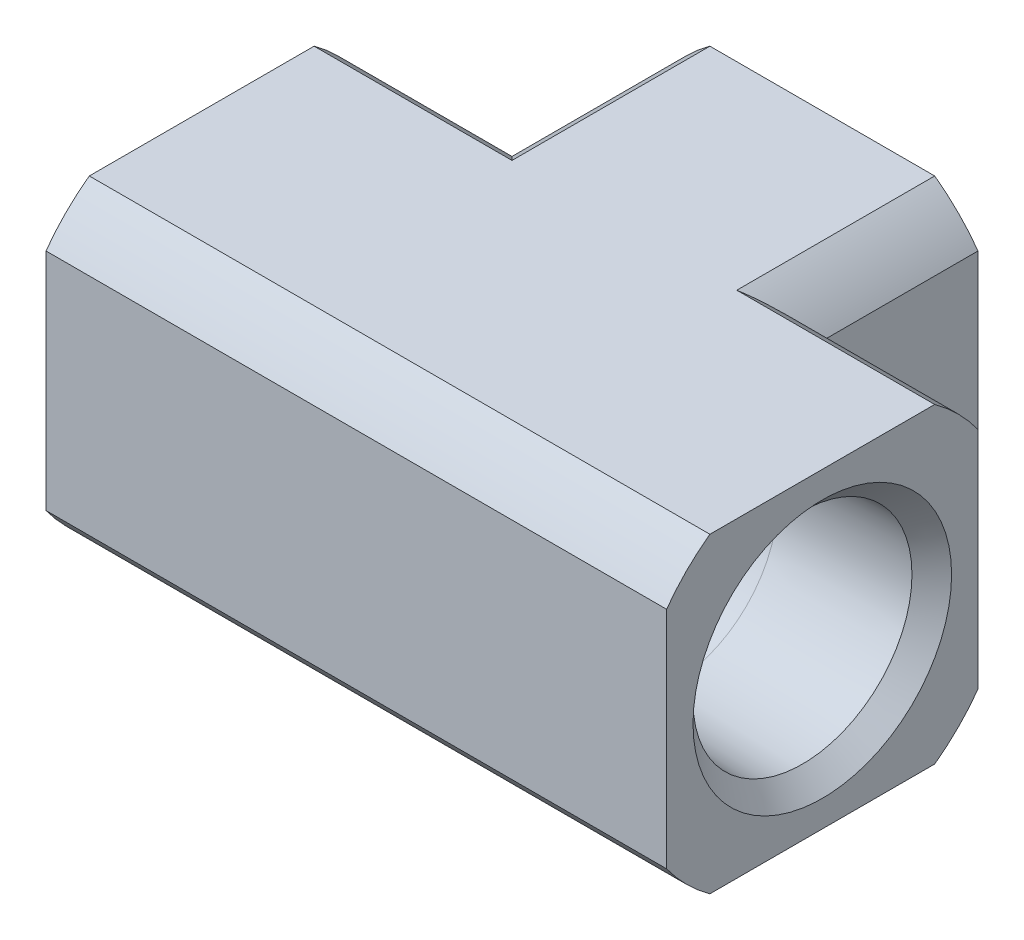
ISO-10303-21;
HEADER;
FILE_DESCRIPTION(('STEP AP214'),'2;1');
FILE_NAME('part.step','',(''),(''),'','','');
FILE_SCHEMA(('AUTOMOTIVE_DESIGN { 1 0 10303 214 1 1 1 1 }'));
ENDSEC;
DATA;
#1=APPLICATION_CONTEXT('core data for automotive mechanical design processes');
#2=APPLICATION_PROTOCOL_DEFINITION('international standard','automotive_design',2000,#1);
#3=PRODUCT_CONTEXT('',#1,'mechanical');
#4=PRODUCT('Part','Part','',(#3));
#5=PRODUCT_RELATED_PRODUCT_CATEGORY('part','',(#4));
#6=PRODUCT_DEFINITION_FORMATION('','',#4);
#7=PRODUCT_DEFINITION_CONTEXT('part definition',#1,'design');
#8=PRODUCT_DEFINITION('design','',#6,#7);
#9=PRODUCT_DEFINITION_SHAPE('','',#8);
#10=(LENGTH_UNIT() NAMED_UNIT(*) SI_UNIT(.MILLI.,.METRE.));
#11=(NAMED_UNIT(*) PLANE_ANGLE_UNIT() SI_UNIT($,.RADIAN.));
#12=(NAMED_UNIT(*) SI_UNIT($,.STERADIAN.) SOLID_ANGLE_UNIT());
#13=UNCERTAINTY_MEASURE_WITH_UNIT(LENGTH_MEASURE(1.E-05),#10,'distance_accuracy_value','');
#14=(GEOMETRIC_REPRESENTATION_CONTEXT(3) GLOBAL_UNCERTAINTY_ASSIGNED_CONTEXT((#13)) GLOBAL_UNIT_ASSIGNED_CONTEXT((#10,
#11,#12)) REPRESENTATION_CONTEXT('',''));
#15=CARTESIAN_POINT('',(0.,0.,0.));
#16=DIRECTION('',(0.,0.,1.));
#17=DIRECTION('',(1.,0.,0.));
#18=AXIS2_PLACEMENT_3D('',#15,#16,#17);
#19=CARTESIAN_POINT('',(7.112,0.,0.));
#20=DIRECTION('',(-1.,0.,0.));
#21=DIRECTION('',(0.,0.,1.));
#22=AXIS2_PLACEMENT_3D('',#19,#20,#21);
#23=CYLINDRICAL_SURFACE('',#22,7.1374);
#24=CARTESIAN_POINT('',(7.112,0.,0.));
#25=DIRECTION('',(-1.,0.,0.));
#26=DIRECTION('',(0.,0.,1.));
#27=AXIS2_PLACEMENT_3D('',#24,#25,#26);
#28=CIRCLE('',#27,7.1374);
#29=CARTESIAN_POINT('',(7.112,0.601610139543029,-7.112));
#30=VERTEX_POINT('',#29);
#31=CARTESIAN_POINT('',(7.112,-0.601610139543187,-7.112));
#32=VERTEX_POINT('',#31);
#33=EDGE_CURVE('E166',#30,#32,#28,.F.);
#34=ORIENTED_EDGE('',*,*,#33,.T.);
#35=CARTESIAN_POINT('',(0.,0.,0.));
#36=DIRECTION('',(-0.707106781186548,0.,-0.707106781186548));
#37=DIRECTION('',(-0.707106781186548,0.,0.707106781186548));
#38=AXIS2_PLACEMENT_3D('',#35,#36,#37);
#39=ELLIPSE('',#38,10.0938078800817,7.1374);
#40=CARTESIAN_POINT('',(0.,-7.13740000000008,0.));
#41=VERTEX_POINT('',#40);
#42=EDGE_CURVE('E197',#32,#41,#39,.T.);
#43=ORIENTED_EDGE('',*,*,#42,.T.);
#44=CARTESIAN_POINT('',(0.,0.,0.));
#45=DIRECTION('',(-0.707106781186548,0.,0.707106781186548));
#46=DIRECTION('',(-0.707106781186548,0.,-0.707106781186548));
#47=AXIS2_PLACEMENT_3D('',#44,#45,#46);
#48=ELLIPSE('',#47,10.0938078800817,7.1374);
#49=CARTESIAN_POINT('',(-7.11199999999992,-0.601610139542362,-7.11200000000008));
#50=VERTEX_POINT('',#49);
#51=EDGE_CURVE('E161',#41,#50,#48,.F.);
#52=ORIENTED_EDGE('',*,*,#51,.T.);
#53=CARTESIAN_POINT('',(-7.112,0.,0.));
#54=DIRECTION('',(-1.,0.,0.));
#55=DIRECTION('',(0.,0.,1.));
#56=AXIS2_PLACEMENT_3D('',#53,#54,#55);
#57=CIRCLE('',#56,7.1374);
#58=CARTESIAN_POINT('',(-7.11199999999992,0.601610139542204,-7.11200000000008));
#59=VERTEX_POINT('',#58);
#60=EDGE_CURVE('E157',#50,#59,#57,.T.);
#61=ORIENTED_EDGE('',*,*,#60,.T.);
#62=CARTESIAN_POINT('',(0.,0.,0.));
#63=DIRECTION('',(-0.707106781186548,0.,0.707106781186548));
#64=DIRECTION('',(-0.707106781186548,0.,-0.707106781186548));
#65=AXIS2_PLACEMENT_3D('',#62,#63,#64);
#66=ELLIPSE('',#65,10.0938078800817,7.1374);
#67=CARTESIAN_POINT('',(0.,7.13739999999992,0.));
#68=VERTEX_POINT('',#67);
#69=EDGE_CURVE('E20',#59,#68,#66,.F.);
#70=ORIENTED_EDGE('',*,*,#69,.T.);
#71=CARTESIAN_POINT('',(0.,0.,0.));
#72=DIRECTION('',(-0.707106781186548,0.,-0.707106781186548));
#73=DIRECTION('',(-0.707106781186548,0.,0.707106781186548));
#74=AXIS2_PLACEMENT_3D('',#71,#72,#73);
#75=ELLIPSE('',#74,10.0938078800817,7.1374);
#76=EDGE_CURVE('E175',#68,#30,#75,.T.);
#77=ORIENTED_EDGE('',*,*,#76,.T.);
#78=EDGE_LOOP('',(#34,#43,#52,#61,#70,#77));
#79=FACE_BOUND('',#78,.T.);
#80=ADVANCED_FACE('F16',(#79),#23,.F.);
#81=CARTESIAN_POINT('',(0.,0.,-7.11200000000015));
#82=DIRECTION('',(0.,0.,1.));
#83=DIRECTION('',(1.,0.,0.));
#84=AXIS2_PLACEMENT_3D('',#81,#82,#83);
#85=CYLINDRICAL_SURFACE('',#84,7.1374);
#86=ORIENTED_EDGE('',*,*,#76,.F.);
#87=ORIENTED_EDGE('',*,*,#69,.F.);
#88=CARTESIAN_POINT('',(0.,0.,-7.112));
#89=DIRECTION('',(0.,0.,1.));
#90=DIRECTION('',(1.,0.,0.));
#91=AXIS2_PLACEMENT_3D('',#88,#89,#90);
#92=CIRCLE('',#91,7.1374);
#93=EDGE_CURVE('E173',#59,#30,#92,.F.);
#94=ORIENTED_EDGE('',*,*,#93,.T.);
#95=EDGE_LOOP('',(#86,#87,#94));
#96=FACE_BOUND('',#95,.T.);
#97=ADVANCED_FACE('F171',(#96),#85,.F.);
#98=CARTESIAN_POINT('',(0.,0.,-7.11200000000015));
#99=DIRECTION('',(0.,0.,1.));
#100=DIRECTION('',(1.,0.,0.));
#101=AXIS2_PLACEMENT_3D('',#98,#99,#100);
#102=CYLINDRICAL_SURFACE('',#101,7.1374);
#103=ORIENTED_EDGE('',*,*,#51,.F.);
#104=ORIENTED_EDGE('',*,*,#42,.F.);
#105=CARTESIAN_POINT('',(0.,0.,-7.112));
#106=DIRECTION('',(0.,0.,1.));
#107=DIRECTION('',(1.,0.,0.));
#108=AXIS2_PLACEMENT_3D('',#105,#106,#107);
#109=CIRCLE('',#108,7.1374);
#110=EDGE_CURVE('E193',#32,#50,#109,.F.);
#111=ORIENTED_EDGE('',*,*,#110,.T.);
#112=EDGE_LOOP('',(#103,#104,#111));
#113=FACE_BOUND('',#112,.T.);
#114=ADVANCED_FACE('F212',(#113),#102,.F.);
#115=CARTESIAN_POINT('',(-7.112,0.,0.));
#116=DIRECTION('',(1.,0.,0.));
#117=DIRECTION('',(0.,0.,-1.));
#118=AXIS2_PLACEMENT_3D('',#115,#116,#117);
#119=PLANE('',#118);
#120=DIRECTION('',(0.,-1.,0.));
#121=VECTOR('',#120,1.);
#122=CARTESIAN_POINT('',(-7.112,-3.95862281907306,-7.112));
#123=LINE('',#122,#121);
#124=CARTESIAN_POINT('',(-7.11199999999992,-1.40348733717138,-7.112));
#125=VERTEX_POINT('',#124);
#126=EDGE_CURVE('E215',#50,#125,#123,.T.);
#127=ORIENTED_EDGE('',*,*,#126,.T.);
#128=CARTESIAN_POINT('',(-7.112,0.,0.));
#129=DIRECTION('',(1.,0.,0.));
#130=DIRECTION('',(0.,0.,-1.));
#131=AXIS2_PLACEMENT_3D('',#128,#129,#130);
#132=CIRCLE('',#131,7.24916);
#133=CARTESIAN_POINT('',(-7.11199999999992,1.40348733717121,-7.11200000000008));
#134=VERTEX_POINT('',#133);
#135=EDGE_CURVE('E179',#125,#134,#132,.F.);
#136=ORIENTED_EDGE('',*,*,#135,.T.);
#137=DIRECTION('',(0.,-1.,0.));
#138=VECTOR('',#137,1.);
#139=CARTESIAN_POINT('',(-7.112,3.95862281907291,-7.112));
#140=LINE('',#139,#138);
#141=EDGE_CURVE('E177',#134,#59,#140,.T.);
#142=ORIENTED_EDGE('',*,*,#141,.T.);
#143=ORIENTED_EDGE('',*,*,#60,.F.);
#144=EDGE_LOOP('',(#127,#136,#142,#143));
#145=FACE_BOUND('',#144,.T.);
#146=ADVANCED_FACE('F178',(#145),#119,.F.);
#147=CARTESIAN_POINT('',(7.112,-7.24916000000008,7.39277159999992));
#148=DIRECTION('',(-1.,0.,0.));
#149=DIRECTION('',(0.,1.,0.));
#150=AXIS2_PLACEMENT_3D('',#147,#148,#149);
#151=PLANE('',#150);
#152=ORIENTED_EDGE('',*,*,#33,.F.);
#153=DIRECTION('',(0.,1.,0.));
#154=VECTOR('',#153,1.);
#155=CARTESIAN_POINT('',(7.112,3.95862281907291,-7.112));
#156=LINE('',#155,#154);
#157=CARTESIAN_POINT('',(7.112,1.40348733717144,-7.112));
#158=VERTEX_POINT('',#157);
#159=EDGE_CURVE('E185',#30,#158,#156,.T.);
#160=ORIENTED_EDGE('',*,*,#159,.T.);
#161=CARTESIAN_POINT('',(7.112,0.,-1.01678522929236E-13));
#162=DIRECTION('',(-1.,0.,0.));
#163=DIRECTION('',(0.,0.,1.));
#164=AXIS2_PLACEMENT_3D('',#161,#162,#163);
#165=CIRCLE('',#164,7.24916);
#166=CARTESIAN_POINT('',(7.112,-1.40348733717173,-7.112));
#167=VERTEX_POINT('',#166);
#168=EDGE_CURVE('E204',#158,#167,#165,.F.);
#169=ORIENTED_EDGE('',*,*,#168,.T.);
#170=DIRECTION('',(0.,1.,0.));
#171=VECTOR('',#170,1.);
#172=CARTESIAN_POINT('',(7.112,-3.95862281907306,-7.112));
#173=LINE('',#172,#171);
#174=EDGE_CURVE('E184',#167,#32,#173,.T.);
#175=ORIENTED_EDGE('',*,*,#174,.T.);
#176=EDGE_LOOP('',(#152,#160,#169,#175));
#177=FACE_BOUND('',#176,.T.);
#178=ADVANCED_FACE('F202',(#177),#151,.F.);
#179=CARTESIAN_POINT('',(7.112,7.31563549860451,-7.112));
#180=DIRECTION('',(0.,0.,1.));
#181=DIRECTION('',(-1.,0.,0.));
#182=AXIS2_PLACEMENT_3D('',#179,#180,#181);
#183=PLANE('',#182);
#184=CARTESIAN_POINT('',(0.,0.,-7.112));
#185=DIRECTION('',(0.,0.,1.));
#186=DIRECTION('',(1.,0.,0.));
#187=AXIS2_PLACEMENT_3D('',#184,#185,#186);
#188=CIRCLE('',#187,7.24916);
#189=EDGE_CURVE('E294',#134,#158,#188,.F.);
#190=ORIENTED_EDGE('',*,*,#189,.T.);
#191=ORIENTED_EDGE('',*,*,#159,.F.);
#192=ORIENTED_EDGE('',*,*,#93,.F.);
#193=ORIENTED_EDGE('',*,*,#141,.F.);
#194=EDGE_LOOP('',(#190,#191,#192,#193));
#195=FACE_BOUND('',#194,.T.);
#196=ADVANCED_FACE('F187',(#195),#183,.F.);
#197=CARTESIAN_POINT('',(7.112,-0.60161013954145,-7.112));
#198=DIRECTION('',(0.,0.,1.));
#199=DIRECTION('',(-1.,0.,0.));
#200=AXIS2_PLACEMENT_3D('',#197,#198,#199);
#201=PLANE('',#200);
#202=ORIENTED_EDGE('',*,*,#110,.F.);
#203=ORIENTED_EDGE('',*,*,#174,.F.);
#204=CARTESIAN_POINT('',(0.,0.,-7.112));
#205=DIRECTION('',(0.,0.,1.));
#206=DIRECTION('',(1.,0.,0.));
#207=AXIS2_PLACEMENT_3D('',#204,#205,#206);
#208=CIRCLE('',#207,7.24916);
#209=EDGE_CURVE('E290',#167,#125,#208,.F.);
#210=ORIENTED_EDGE('',*,*,#209,.T.);
#211=ORIENTED_EDGE('',*,*,#126,.F.);
#212=EDGE_LOOP('',(#202,#203,#210,#211));
#213=FACE_BOUND('',#212,.T.);
#214=ADVANCED_FACE('F214',(#213),#201,.F.);
#215=CARTESIAN_POINT('',(-14.224,0.,0.));
#216=DIRECTION('',(1.,0.,0.));
#217=DIRECTION('',(0.,0.,-1.));
#218=AXIS2_PLACEMENT_3D('',#215,#216,#217);
#219=CYLINDRICAL_SURFACE('',#218,7.24916);
#220=ORIENTED_EDGE('',*,*,#135,.F.);
#221=CARTESIAN_POINT('',(0.,0.,0.));
#222=DIRECTION('',(0.707106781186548,0.,-0.707106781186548));
#223=DIRECTION('',(0.707106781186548,0.,0.707106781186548));
#224=AXIS2_PLACEMENT_3D('',#221,#222,#223);
#225=ELLIPSE('',#224,10.2518603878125,7.24916);
#226=EDGE_CURVE('E288',#125,#134,#225,.T.);
#227=ORIENTED_EDGE('',*,*,#226,.T.);
#228=EDGE_LOOP('',(#220,#227));
#229=FACE_BOUND('',#228,.T.);
#230=CARTESIAN_POINT('',(-11.015820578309,0.,0.));
#231=DIRECTION('',(-1.,0.,0.));
#232=DIRECTION('',(0.,-1.,0.));
#233=AXIS2_PLACEMENT_3D('',#230,#231,#232);
#234=CIRCLE('',#233,7.24916);
#235=CARTESIAN_POINT('',(-11.015820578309,-7.24916,0.));
#236=VERTEX_POINT('',#235);
#237=EDGE_CURVE('E218',#236,#236,#234,.T.);
#238=ORIENTED_EDGE('',*,*,#237,.T.);
#239=EDGE_LOOP('',(#238));
#240=FACE_BOUND('',#239,.T.);
#241=ADVANCED_FACE('F304',(#229,#240),#219,.F.);
#242=CARTESIAN_POINT('',(11.015820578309,0.,0.));
#243=DIRECTION('',(-1.,0.,0.));
#244=DIRECTION('',(0.,0.,1.));
#245=AXIS2_PLACEMENT_3D('',#242,#243,#244);
#246=CYLINDRICAL_SURFACE('',#245,7.24916);
#247=CARTESIAN_POINT('',(0.,0.,-1.26920926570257E-13));
#248=DIRECTION('',(-0.707106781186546,0.,-0.707106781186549));
#249=DIRECTION('',(-0.707106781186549,0.,0.707106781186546));
#250=AXIS2_PLACEMENT_3D('',#247,#248,#249);
#251=ELLIPSE('',#250,10.2518603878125,7.24916);
#252=EDGE_CURVE('E292',#158,#167,#251,.T.);
#253=ORIENTED_EDGE('',*,*,#252,.T.);
#254=ORIENTED_EDGE('',*,*,#168,.F.);
#255=EDGE_LOOP('',(#253,#254));
#256=FACE_BOUND('',#255,.T.);
#257=CARTESIAN_POINT('',(11.0158205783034,0.,0.));
#258=DIRECTION('',(1.,0.,0.));
#259=DIRECTION('',(0.,0.,1.));
#260=AXIS2_PLACEMENT_3D('',#257,#258,#259);
#261=CIRCLE('',#260,7.24916000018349);
#262=CARTESIAN_POINT('',(11.0158205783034,0.,7.24916000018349));
#263=VERTEX_POINT('',#262);
#264=EDGE_CURVE('E311',#263,#263,#261,.T.);
#265=ORIENTED_EDGE('',*,*,#264,.T.);
#266=EDGE_LOOP('',(#265));
#267=FACE_BOUND('',#266,.T.);
#268=ADVANCED_FACE('F299',(#256,#267),#246,.F.);
#269=CARTESIAN_POINT('',(0.,0.,-11.00582));
#270=DIRECTION('',(0.,0.,1.));
#271=DIRECTION('',(1.,0.,0.));
#272=AXIS2_PLACEMENT_3D('',#269,#270,#271);
#273=CYLINDRICAL_SURFACE('',#272,7.24916);
#274=ORIENTED_EDGE('',*,*,#252,.F.);
#275=ORIENTED_EDGE('',*,*,#189,.F.);
#276=ORIENTED_EDGE('',*,*,#226,.F.);
#277=ORIENTED_EDGE('',*,*,#209,.F.);
#278=EDGE_LOOP('',(#274,#275,#276,#277));
#279=FACE_BOUND('',#278,.T.);
#280=CARTESIAN_POINT('',(0.,0.,-11.0058199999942));
#281=DIRECTION('',(0.,0.,-1.));
#282=DIRECTION('',(0.,-1.,0.));
#283=AXIS2_PLACEMENT_3D('',#280,#281,#282);
#284=CIRCLE('',#283,7.24916000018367);
#285=CARTESIAN_POINT('',(0.,-7.24916000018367,-11.0058199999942));
#286=VERTEX_POINT('',#285);
#287=EDGE_CURVE('E313',#286,#286,#284,.T.);
#288=ORIENTED_EDGE('',*,*,#287,.T.);
#289=EDGE_LOOP('',(#288));
#290=FACE_BOUND('',#289,.T.);
#291=ADVANCED_FACE('F301',(#279,#290),#273,.F.);
#292=CARTESIAN_POINT('',(-11.015820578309,0.,0.));
#293=DIRECTION('',(-1.,0.,0.));
#294=DIRECTION('',(0.,-1.,0.));
#295=AXIS2_PLACEMENT_3D('',#292,#293,#294);
#296=CONICAL_SURFACE('',#295,7.24916,0.031119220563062);
#297=ORIENTED_EDGE('',*,*,#237,.F.);
#298=EDGE_LOOP('',(#297));
#299=FACE_BOUND('',#298,.T.);
#300=CARTESIAN_POINT('',(-19.9740222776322,0.,0.));
#301=DIRECTION('',(-1.,0.,0.));
#302=DIRECTION('',(0.,0.,1.));
#303=AXIS2_PLACEMENT_3D('',#300,#301,#302);
#304=CIRCLE('',#303,7.52802227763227);
#305=CARTESIAN_POINT('',(-19.9740222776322,0.,7.52802227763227));
#306=VERTEX_POINT('',#305);
#307=EDGE_CURVE('E319',#306,#306,#304,.T.);
#308=ORIENTED_EDGE('',*,*,#307,.T.);
#309=EDGE_LOOP('',(#308));
#310=FACE_BOUND('',#309,.T.);
#311=ADVANCED_FACE('F647',(#299,#310),#296,.F.);
#312=CARTESIAN_POINT('',(19.9740222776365,0.,0.));
#313=DIRECTION('',(1.,0.,0.));
#314=DIRECTION('',(0.,0.,-1.));
#315=AXIS2_PLACEMENT_3D('',#312,#313,#314);
#316=CONICAL_SURFACE('',#315,7.52802227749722,0.0311192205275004);
#317=CARTESIAN_POINT('',(19.9740222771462,0.,0.));
#318=DIRECTION('',(1.,0.,0.));
#319=DIRECTION('',(0.,0.,1.));
#320=AXIS2_PLACEMENT_3D('',#317,#318,#319);
#321=CIRCLE('',#320,7.52802227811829);
#322=CARTESIAN_POINT('',(19.9740222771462,0.,7.52802227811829));
#323=VERTEX_POINT('',#322);
#324=EDGE_CURVE('E323',#323,#323,#321,.T.);
#325=ORIENTED_EDGE('',*,*,#324,.T.);
#326=EDGE_LOOP('',(#325));
#327=FACE_BOUND('',#326,.T.);
#328=ORIENTED_EDGE('',*,*,#264,.F.);
#329=EDGE_LOOP('',(#328));
#330=FACE_BOUND('',#329,.T.);
#331=ADVANCED_FACE('F654',(#327,#330),#316,.F.);
#332=CARTESIAN_POINT('',(0.,0.,-19.974343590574));
#333=DIRECTION('',(0.,0.,-1.));
#334=DIRECTION('',(0.,1.,0.));
#335=AXIS2_PLACEMENT_3D('',#332,#333,#334);
#336=CONICAL_SURFACE('',#335,7.52834359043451,0.0311192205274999);
#337=ORIENTED_EDGE('',*,*,#287,.F.);
#338=EDGE_LOOP('',(#337));
#339=FACE_BOUND('',#338,.T.);
#340=CARTESIAN_POINT('',(0.,0.,-19.974343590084));
#341=DIRECTION('',(0.,0.,-1.));
#342=DIRECTION('',(0.,-1.,0.));
#343=AXIS2_PLACEMENT_3D('',#340,#341,#342);
#344=CIRCLE('',#343,7.52834359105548);
#345=CARTESIAN_POINT('',(0.,-7.52834359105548,-19.974343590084));
#346=VERTEX_POINT('',#345);
#347=EDGE_CURVE('E326',#346,#346,#344,.T.);
#348=ORIENTED_EDGE('',*,*,#347,.T.);
#349=EDGE_LOOP('',(#348));
#350=FACE_BOUND('',#349,.T.);
#351=ADVANCED_FACE('F661',(#339,#350),#336,.F.);
#352=CARTESIAN_POINT('',(0.,0.,0.));
#353=DIRECTION('',(1.,0.,0.));
#354=DIRECTION('',(0.,0.,-1.));
#355=AXIS2_PLACEMENT_3D('',#352,#353,#354);
#356=CYLINDRICAL_SURFACE('',#355,13.20419);
#357=CARTESIAN_POINT('',(-21.336,0.,0.));
#358=DIRECTION('',(1.,0.,0.));
#359=DIRECTION('',(0.,0.,-1.));
#360=AXIS2_PLACEMENT_3D('',#357,#358,#359);
#361=CIRCLE('',#360,13.20419);
#362=CARTESIAN_POINT('',(-21.336,-10.7061,-7.72852226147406));
#363=VERTEX_POINT('',#362);
#364=CARTESIAN_POINT('',(-21.336,-7.72852226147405,-10.7061));
#365=VERTEX_POINT('',#364);
#366=EDGE_CURVE('E275',#363,#365,#361,.T.);
#367=ORIENTED_EDGE('',*,*,#366,.T.);
#368=DIRECTION('',(-1.,0.,0.));
#369=VECTOR('',#368,1.);
#370=CARTESIAN_POINT('',(0.,-7.72852226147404,-10.7061));
#371=LINE('',#370,#369);
#372=CARTESIAN_POINT('',(-10.7061,-7.72852226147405,-10.7061));
#373=VERTEX_POINT('',#372);
#374=EDGE_CURVE('E316',#373,#365,#371,.T.);
#375=ORIENTED_EDGE('',*,*,#374,.F.);
#376=CARTESIAN_POINT('',(0.,0.,0.));
#377=DIRECTION('',(0.707106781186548,0.,-0.707106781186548));
#378=DIRECTION('',(0.707106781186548,0.,0.707106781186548));
#379=AXIS2_PLACEMENT_3D('',#376,#377,#378);
#380=ELLIPSE('',#379,18.6735445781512,13.20419);
#381=CARTESIAN_POINT('',(-7.72852226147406,-10.7061,-7.72852226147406));
#382=VERTEX_POINT('',#381);
#383=EDGE_CURVE('E283',#382,#373,#380,.T.);
#384=ORIENTED_EDGE('',*,*,#383,.F.);
#385=DIRECTION('',(1.,0.,0.));
#386=VECTOR('',#385,1.);
#387=CARTESIAN_POINT('',(0.,-10.7061,-7.72852226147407));
#388=LINE('',#387,#386);
#389=EDGE_CURVE('E331',#363,#382,#388,.T.);
#390=ORIENTED_EDGE('',*,*,#389,.F.);
#391=EDGE_LOOP('',(#367,#375,#384,#390));
#392=FACE_BOUND('',#391,.T.);
#393=ADVANCED_FACE('F414',(#392),#356,.T.);
#394=CARTESIAN_POINT('',(0.,7.72852226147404,-10.7061));
#395=DIRECTION('',(0.,0.,-1.));
#396=DIRECTION('',(-1.,0.,0.));
#397=AXIS2_PLACEMENT_3D('',#394,#395,#396);
#398=PLANE('',#397);
#399=DIRECTION('',(0.,1.,0.));
#400=VECTOR('',#399,1.);
#401=CARTESIAN_POINT('',(-21.336,0.,-10.7061));
#402=LINE('',#401,#400);
#403=CARTESIAN_POINT('',(-21.336,7.72852226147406,-10.7061));
#404=VERTEX_POINT('',#403);
#405=EDGE_CURVE('E274',#365,#404,#402,.T.);
#406=ORIENTED_EDGE('',*,*,#405,.T.);
#407=DIRECTION('',(1.,0.,0.));
#408=VECTOR('',#407,1.);
#409=CARTESIAN_POINT('',(0.,7.72852226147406,-10.7061));
#410=LINE('',#409,#408);
#411=CARTESIAN_POINT('',(-10.7061,7.72852226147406,-10.7061));
#412=VERTEX_POINT('',#411);
#413=EDGE_CURVE('E350',#412,#404,#410,.F.);
#414=ORIENTED_EDGE('',*,*,#413,.F.);
#415=DIRECTION('',(0.,1.,0.));
#416=VECTOR('',#415,1.);
#417=CARTESIAN_POINT('',(-10.7061,7.72852226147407,-10.7061));
#418=LINE('',#417,#416);
#419=EDGE_CURVE('E329',#373,#412,#418,.T.);
#420=ORIENTED_EDGE('',*,*,#419,.F.);
#421=ORIENTED_EDGE('',*,*,#374,.T.);
#422=EDGE_LOOP('',(#406,#414,#420,#421));
#423=FACE_BOUND('',#422,.T.);
#424=ADVANCED_FACE('F408',(#423),#398,.T.);
#425=CARTESIAN_POINT('',(-19.9740222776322,0.,0.));
#426=DIRECTION('',(-1.,0.,0.));
#427=DIRECTION('',(0.,0.,1.));
#428=AXIS2_PLACEMENT_3D('',#425,#426,#427);
#429=CONICAL_SURFACE('',#428,7.52802227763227,0.785398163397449);
#430=ORIENTED_EDGE('',*,*,#307,.F.);
#431=EDGE_LOOP('',(#430));
#432=FACE_BOUND('',#431,.T.);
#433=CARTESIAN_POINT('',(-21.336,0.,0.));
#434=DIRECTION('',(-1.,0.,0.));
#435=DIRECTION('',(0.,0.,1.));
#436=AXIS2_PLACEMENT_3D('',#433,#434,#435);
#437=CIRCLE('',#436,8.89);
#438=CARTESIAN_POINT('',(-21.336,0.,8.89));
#439=VERTEX_POINT('',#438);
#440=EDGE_CURVE('E265',#439,#439,#437,.T.);
#441=ORIENTED_EDGE('',*,*,#440,.T.);
#442=EDGE_LOOP('',(#441));
#443=FACE_BOUND('',#442,.T.);
#444=ADVANCED_FACE('F18',(#432,#443),#429,.F.);
#445=CARTESIAN_POINT('',(0.,-7.72852226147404,10.7061));
#446=DIRECTION('',(0.,0.,1.));
#447=DIRECTION('',(1.,0.,0.));
#448=AXIS2_PLACEMENT_3D('',#445,#446,#447);
#449=PLANE('',#448);
#450=DIRECTION('',(0.,1.,0.));
#451=VECTOR('',#450,1.);
#452=CARTESIAN_POINT('',(-21.336,0.,10.7061));
#453=LINE('',#452,#451);
#454=CARTESIAN_POINT('',(-21.336,7.72852226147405,10.7061));
#455=VERTEX_POINT('',#454);
#456=CARTESIAN_POINT('',(-21.336,-7.72852226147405,10.7061));
#457=VERTEX_POINT('',#456);
#458=EDGE_CURVE('E271',#455,#457,#453,.F.);
#459=ORIENTED_EDGE('',*,*,#458,.T.);
#460=DIRECTION('',(1.,0.,0.));
#461=VECTOR('',#460,1.);
#462=CARTESIAN_POINT('',(0.,-7.72852226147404,10.7061));
#463=LINE('',#462,#461);
#464=CARTESIAN_POINT('',(21.336,-7.72852226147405,10.7061));
#465=VERTEX_POINT('',#464);
#466=EDGE_CURVE('E322',#465,#457,#463,.F.);
#467=ORIENTED_EDGE('',*,*,#466,.F.);
#468=DIRECTION('',(0.,1.,0.));
#469=VECTOR('',#468,1.);
#470=CARTESIAN_POINT('',(21.336,0.,10.7061));
#471=LINE('',#470,#469);
#472=CARTESIAN_POINT('',(21.336,7.72852226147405,10.7061));
#473=VERTEX_POINT('',#472);
#474=EDGE_CURVE('E257',#473,#465,#471,.F.);
#475=ORIENTED_EDGE('',*,*,#474,.F.);
#476=DIRECTION('',(1.,0.,0.));
#477=VECTOR('',#476,1.);
#478=CARTESIAN_POINT('',(0.,7.72852226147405,10.7061));
#479=LINE('',#478,#477);
#480=EDGE_CURVE('E261',#455,#473,#479,.T.);
#481=ORIENTED_EDGE('',*,*,#480,.F.);
#482=EDGE_LOOP('',(#459,#467,#475,#481));
#483=FACE_BOUND('',#482,.T.);
#484=ADVANCED_FACE('F451',(#483),#449,.T.);
#485=CARTESIAN_POINT('',(0.,0.,0.));
#486=DIRECTION('',(1.,0.,0.));
#487=DIRECTION('',(0.,0.,-1.));
#488=AXIS2_PLACEMENT_3D('',#485,#486,#487);
#489=CYLINDRICAL_SURFACE('',#488,13.20419);
#490=CARTESIAN_POINT('',(-21.336,0.,0.));
#491=DIRECTION('',(1.,0.,0.));
#492=DIRECTION('',(0.,0.,-1.));
#493=AXIS2_PLACEMENT_3D('',#490,#491,#492);
#494=CIRCLE('',#493,13.20419);
#495=CARTESIAN_POINT('',(-21.336,-10.7061,7.72852226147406));
#496=VERTEX_POINT('',#495);
#497=EDGE_CURVE('E268',#457,#496,#494,.T.);
#498=ORIENTED_EDGE('',*,*,#497,.T.);
#499=DIRECTION('',(1.,0.,0.));
#500=VECTOR('',#499,1.);
#501=CARTESIAN_POINT('',(0.,-10.7061,7.72852226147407));
#502=LINE('',#501,#500);
#503=CARTESIAN_POINT('',(21.336,-10.7061,7.72852226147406));
#504=VERTEX_POINT('',#503);
#505=EDGE_CURVE('E334',#504,#496,#502,.F.);
#506=ORIENTED_EDGE('',*,*,#505,.F.);
#507=CARTESIAN_POINT('',(21.336,0.,0.));
#508=DIRECTION('',(1.,0.,0.));
#509=DIRECTION('',(0.,0.,-1.));
#510=AXIS2_PLACEMENT_3D('',#507,#508,#509);
#511=CIRCLE('',#510,13.20419);
#512=EDGE_CURVE('E254',#465,#504,#511,.T.);
#513=ORIENTED_EDGE('',*,*,#512,.F.);
#514=ORIENTED_EDGE('',*,*,#466,.T.);
#515=EDGE_LOOP('',(#498,#506,#513,#514));
#516=FACE_BOUND('',#515,.T.);
#517=ADVANCED_FACE('F446',(#516),#489,.T.);
#518=CARTESIAN_POINT('',(0.,0.,0.));
#519=DIRECTION('',(1.,0.,0.));
#520=DIRECTION('',(0.,0.,-1.));
#521=AXIS2_PLACEMENT_3D('',#518,#519,#520);
#522=CYLINDRICAL_SURFACE('',#521,13.20419);
#523=CARTESIAN_POINT('',(21.336,0.,0.));
#524=DIRECTION('',(1.,0.,0.));
#525=DIRECTION('',(0.,0.,-1.));
#526=AXIS2_PLACEMENT_3D('',#523,#524,#525);
#527=CIRCLE('',#526,13.20419);
#528=CARTESIAN_POINT('',(21.336,-10.7061,-7.72852226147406));
#529=VERTEX_POINT('',#528);
#530=CARTESIAN_POINT('',(21.336,-7.72852226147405,-10.7061));
#531=VERTEX_POINT('',#530);
#532=EDGE_CURVE('E250',#529,#531,#527,.T.);
#533=ORIENTED_EDGE('',*,*,#532,.F.);
#534=DIRECTION('',(1.,0.,0.));
#535=VECTOR('',#534,1.);
#536=CARTESIAN_POINT('',(0.,-10.7061,-7.72852226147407));
#537=LINE('',#536,#535);
#538=CARTESIAN_POINT('',(7.72852226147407,-10.7061,-7.72852226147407));
#539=VERTEX_POINT('',#538);
#540=EDGE_CURVE('E286',#539,#529,#537,.T.);
#541=ORIENTED_EDGE('',*,*,#540,.F.);
#542=CARTESIAN_POINT('',(0.,0.,0.));
#543=DIRECTION('',(0.707106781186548,0.,0.707106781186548));
#544=DIRECTION('',(0.707106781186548,0.,-0.707106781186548));
#545=AXIS2_PLACEMENT_3D('',#542,#543,#544);
#546=ELLIPSE('',#545,18.6735445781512,13.20419);
#547=CARTESIAN_POINT('',(10.7061,-7.72852226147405,-10.7061));
#548=VERTEX_POINT('',#547);
#549=EDGE_CURVE('E278',#548,#539,#546,.F.);
#550=ORIENTED_EDGE('',*,*,#549,.F.);
#551=DIRECTION('',(-1.,0.,0.));
#552=VECTOR('',#551,1.);
#553=CARTESIAN_POINT('',(0.,-7.72852226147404,-10.7061));
#554=LINE('',#553,#552);
#555=EDGE_CURVE('E287',#531,#548,#554,.T.);
#556=ORIENTED_EDGE('',*,*,#555,.F.);
#557=EDGE_LOOP('',(#533,#541,#550,#556));
#558=FACE_BOUND('',#557,.T.);
#559=ADVANCED_FACE('F466',(#558),#522,.T.);
#560=CARTESIAN_POINT('',(21.3360000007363,0.,0.));
#561=DIRECTION('',(1.,0.,0.));
#562=DIRECTION('',(0.,0.,-1.));
#563=AXIS2_PLACEMENT_3D('',#560,#561,#562);
#564=CONICAL_SURFACE('',#563,8.88999999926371,0.785398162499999);
#565=CARTESIAN_POINT('',(21.3360000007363,0.,0.));
#566=DIRECTION('',(1.,0.,0.));
#567=DIRECTION('',(0.,0.,-1.));
#568=AXIS2_PLACEMENT_3D('',#565,#566,#567);
#569=CIRCLE('',#568,8.88999999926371);
#570=CARTESIAN_POINT('',(21.3360000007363,0.,-8.88999999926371));
#571=VERTEX_POINT('',#570);
#572=EDGE_CURVE('E246',#571,#571,#569,.F.);
#573=ORIENTED_EDGE('',*,*,#572,.F.);
#574=EDGE_LOOP('',(#573));
#575=FACE_BOUND('',#574,.T.);
#576=ORIENTED_EDGE('',*,*,#324,.F.);
#577=EDGE_LOOP('',(#576));
#578=FACE_BOUND('',#577,.T.);
#579=ADVANCED_FACE('F468',(#575,#578),#564,.F.);
#580=CARTESIAN_POINT('',(0.,7.72852226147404,-10.7061));
#581=DIRECTION('',(0.,0.,-1.));
#582=DIRECTION('',(-1.,0.,0.));
#583=AXIS2_PLACEMENT_3D('',#580,#581,#582);
#584=PLANE('',#583);
#585=DIRECTION('',(0.,1.,0.));
#586=VECTOR('',#585,1.);
#587=CARTESIAN_POINT('',(21.336,0.,-10.7061));
#588=LINE('',#587,#586);
#589=CARTESIAN_POINT('',(21.336,7.72852226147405,-10.7061));
#590=VERTEX_POINT('',#589);
#591=EDGE_CURVE('E249',#531,#590,#588,.T.);
#592=ORIENTED_EDGE('',*,*,#591,.F.);
#593=ORIENTED_EDGE('',*,*,#555,.T.);
#594=DIRECTION('',(0.,1.,0.));
#595=VECTOR('',#594,1.);
#596=CARTESIAN_POINT('',(10.7061,-7.72852226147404,-10.7061));
#597=LINE('',#596,#595);
#598=CARTESIAN_POINT('',(10.7061,7.72852226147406,-10.7061));
#599=VERTEX_POINT('',#598);
#600=EDGE_CURVE('E344',#599,#548,#597,.F.);
#601=ORIENTED_EDGE('',*,*,#600,.F.);
#602=DIRECTION('',(1.,0.,0.));
#603=VECTOR('',#602,1.);
#604=CARTESIAN_POINT('',(0.,7.72852226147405,-10.7061));
#605=LINE('',#604,#603);
#606=EDGE_CURVE('E242',#590,#599,#605,.F.);
#607=ORIENTED_EDGE('',*,*,#606,.F.);
#608=EDGE_LOOP('',(#592,#593,#601,#607));
#609=FACE_BOUND('',#608,.T.);
#610=ADVANCED_FACE('F463',(#609),#584,.T.);
#611=CARTESIAN_POINT('',(0.,0.,0.));
#612=DIRECTION('',(0.,0.,-1.));
#613=DIRECTION('',(-1.,0.,0.));
#614=AXIS2_PLACEMENT_3D('',#611,#612,#613);
#615=CYLINDRICAL_SURFACE('',#614,13.20419);
#616=CARTESIAN_POINT('',(0.,0.,-21.336));
#617=DIRECTION('',(0.,0.,-1.));
#618=DIRECTION('',(-1.,0.,0.));
#619=AXIS2_PLACEMENT_3D('',#616,#617,#618);
#620=CIRCLE('',#619,13.20419);
#621=CARTESIAN_POINT('',(-10.7061,-7.72852226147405,-21.336));
#622=VERTEX_POINT('',#621);
#623=CARTESIAN_POINT('',(-7.72852226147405,-10.7061,-21.336));
#624=VERTEX_POINT('',#623);
#625=EDGE_CURVE('E235',#622,#624,#620,.F.);
#626=ORIENTED_EDGE('',*,*,#625,.T.);
#627=DIRECTION('',(0.,0.,-1.));
#628=VECTOR('',#627,1.);
#629=CARTESIAN_POINT('',(-7.72852226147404,-10.7061,-7.72852226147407));
#630=LINE('',#629,#628);
#631=EDGE_CURVE('E282',#382,#624,#630,.T.);
#632=ORIENTED_EDGE('',*,*,#631,.F.);
#633=ORIENTED_EDGE('',*,*,#383,.T.);
#634=DIRECTION('',(0.,0.,1.));
#635=VECTOR('',#634,1.);
#636=CARTESIAN_POINT('',(-10.7061,-7.72852226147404,0.));
#637=LINE('',#636,#635);
#638=EDGE_CURVE('E347',#622,#373,#637,.T.);
#639=ORIENTED_EDGE('',*,*,#638,.F.);
#640=EDGE_LOOP('',(#626,#632,#633,#639));
#641=FACE_BOUND('',#640,.T.);
#642=ADVANCED_FACE('F412',(#641),#615,.T.);
#643=CARTESIAN_POINT('',(0.,-10.7061,-7.72852226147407));
#644=DIRECTION('',(0.,-1.,0.));
#645=DIRECTION('',(0.,0.,-1.));
#646=AXIS2_PLACEMENT_3D('',#643,#644,#645);
#647=PLANE('',#646);
#648=DIRECTION('',(1.,0.,0.));
#649=VECTOR('',#648,1.);
#650=CARTESIAN_POINT('',(0.,-10.7061,-21.336));
#651=LINE('',#650,#649);
#652=CARTESIAN_POINT('',(7.72852226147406,-10.7061,-21.336));
#653=VERTEX_POINT('',#652);
#654=EDGE_CURVE('E234',#624,#653,#651,.T.);
#655=ORIENTED_EDGE('',*,*,#654,.T.);
#656=DIRECTION('',(0.,0.,-1.));
#657=VECTOR('',#656,1.);
#658=CARTESIAN_POINT('',(7.72852226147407,-10.7061,0.));
#659=LINE('',#658,#657);
#660=EDGE_CURVE('E281',#539,#653,#659,.T.);
#661=ORIENTED_EDGE('',*,*,#660,.F.);
#662=ORIENTED_EDGE('',*,*,#540,.T.);
#663=DIRECTION('',(0.,0.,-1.));
#664=VECTOR('',#663,1.);
#665=CARTESIAN_POINT('',(21.336,-10.7061,0.));
#666=LINE('',#665,#664);
#667=EDGE_CURVE('E253',#504,#529,#666,.T.);
#668=ORIENTED_EDGE('',*,*,#667,.F.);
#669=ORIENTED_EDGE('',*,*,#505,.T.);
#670=DIRECTION('',(0.,0.,-1.));
#671=VECTOR('',#670,1.);
#672=CARTESIAN_POINT('',(-21.336,-10.7061,0.));
#673=LINE('',#672,#671);
#674=EDGE_CURVE('E277',#496,#363,#673,.T.);
#675=ORIENTED_EDGE('',*,*,#674,.T.);
#676=ORIENTED_EDGE('',*,*,#389,.T.);
#677=ORIENTED_EDGE('',*,*,#631,.T.);
#678=EDGE_LOOP('',(#655,#661,#662,#668,#669,#675,#676,#677));
#679=FACE_BOUND('',#678,.T.);
#680=ADVANCED_FACE('F442',(#679),#647,.T.);
#681=CARTESIAN_POINT('',(0.,0.,0.));
#682=DIRECTION('',(0.,0.,-1.));
#683=DIRECTION('',(-1.,0.,0.));
#684=AXIS2_PLACEMENT_3D('',#681,#682,#683);
#685=CYLINDRICAL_SURFACE('',#684,13.20419);
#686=CARTESIAN_POINT('',(0.,0.,-21.336));
#687=DIRECTION('',(0.,0.,-1.));
#688=DIRECTION('',(-1.,0.,0.));
#689=AXIS2_PLACEMENT_3D('',#686,#687,#688);
#690=CIRCLE('',#689,13.20419);
#691=CARTESIAN_POINT('',(10.7061,-7.72852226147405,-21.336));
#692=VERTEX_POINT('',#691);
#693=EDGE_CURVE('E232',#653,#692,#690,.F.);
#694=ORIENTED_EDGE('',*,*,#693,.T.);
#695=DIRECTION('',(0.,0.,-1.));
#696=VECTOR('',#695,1.);
#697=CARTESIAN_POINT('',(10.7061,-7.72852226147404,0.));
#698=LINE('',#697,#696);
#699=EDGE_CURVE('E330',#548,#692,#698,.T.);
#700=ORIENTED_EDGE('',*,*,#699,.F.);
#701=ORIENTED_EDGE('',*,*,#549,.T.);
#702=ORIENTED_EDGE('',*,*,#660,.T.);
#703=EDGE_LOOP('',(#694,#700,#701,#702));
#704=FACE_BOUND('',#703,.T.);
#705=ADVANCED_FACE('F438',(#704),#685,.T.);
#706=CARTESIAN_POINT('',(10.7061,-7.72852226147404,0.));
#707=DIRECTION('',(1.,0.,0.));
#708=DIRECTION('',(0.,0.,-1.));
#709=AXIS2_PLACEMENT_3D('',#706,#707,#708);
#710=PLANE('',#709);
#711=DIRECTION('',(0.,1.,0.));
#712=VECTOR('',#711,1.);
#713=CARTESIAN_POINT('',(10.7061,0.,-21.336));
#714=LINE('',#713,#712);
#715=CARTESIAN_POINT('',(10.7061,7.72852226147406,-21.336));
#716=VERTEX_POINT('',#715);
#717=EDGE_CURVE('E231',#692,#716,#714,.T.);
#718=ORIENTED_EDGE('',*,*,#717,.T.);
#719=DIRECTION('',(0.,0.,-1.));
#720=VECTOR('',#719,1.);
#721=CARTESIAN_POINT('',(10.7061,7.72852226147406,0.));
#722=LINE('',#721,#720);
#723=EDGE_CURVE('E241',#599,#716,#722,.T.);
#724=ORIENTED_EDGE('',*,*,#723,.F.);
#725=ORIENTED_EDGE('',*,*,#600,.T.);
#726=ORIENTED_EDGE('',*,*,#699,.T.);
#727=EDGE_LOOP('',(#718,#724,#725,#726));
#728=FACE_BOUND('',#727,.T.);
#729=ADVANCED_FACE('F435',(#728),#710,.T.);
#730=CARTESIAN_POINT('',(0.,0.,-21.3360000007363));
#731=DIRECTION('',(0.,0.,-1.));
#732=DIRECTION('',(-1.,0.,0.));
#733=AXIS2_PLACEMENT_3D('',#730,#731,#732);
#734=CONICAL_SURFACE('',#733,8.88999999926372,0.7853981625);
#735=ORIENTED_EDGE('',*,*,#347,.F.);
#736=EDGE_LOOP('',(#735));
#737=FACE_BOUND('',#736,.T.);
#738=CARTESIAN_POINT('',(0.,0.,-21.3360000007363));
#739=DIRECTION('',(0.,0.,-1.));
#740=DIRECTION('',(-1.,0.,0.));
#741=AXIS2_PLACEMENT_3D('',#738,#739,#740);
#742=CIRCLE('',#741,8.88999999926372);
#743=CARTESIAN_POINT('',(-8.88999999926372,0.,-21.3360000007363));
#744=VERTEX_POINT('',#743);
#745=EDGE_CURVE('E226',#744,#744,#742,.T.);
#746=ORIENTED_EDGE('',*,*,#745,.T.);
#747=EDGE_LOOP('',(#746));
#748=FACE_BOUND('',#747,.T.);
#749=ADVANCED_FACE('F506',(#737,#748),#734,.F.);
#750=CARTESIAN_POINT('',(-10.7061,7.72852226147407,0.));
#751=DIRECTION('',(-1.,0.,0.));
#752=DIRECTION('',(0.,0.,1.));
#753=AXIS2_PLACEMENT_3D('',#750,#751,#752);
#754=PLANE('',#753);
#755=DIRECTION('',(0.,1.,0.));
#756=VECTOR('',#755,1.);
#757=CARTESIAN_POINT('',(-10.7061,0.,-21.336));
#758=LINE('',#757,#756);
#759=CARTESIAN_POINT('',(-10.7061,7.72852226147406,-21.336));
#760=VERTEX_POINT('',#759);
#761=EDGE_CURVE('E237',#760,#622,#758,.F.);
#762=ORIENTED_EDGE('',*,*,#761,.T.);
#763=ORIENTED_EDGE('',*,*,#638,.T.);
#764=ORIENTED_EDGE('',*,*,#419,.T.);
#765=DIRECTION('',(0.,0.,-1.));
#766=VECTOR('',#765,1.);
#767=CARTESIAN_POINT('',(-10.7061,7.72852226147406,0.));
#768=LINE('',#767,#766);
#769=EDGE_CURVE('E222',#760,#412,#768,.F.);
#770=ORIENTED_EDGE('',*,*,#769,.F.);
#771=EDGE_LOOP('',(#762,#763,#764,#770));
#772=FACE_BOUND('',#771,.T.);
#773=ADVANCED_FACE('F404',(#772),#754,.T.);
#774=CARTESIAN_POINT('',(0.,0.,0.));
#775=DIRECTION('',(1.,0.,0.));
#776=DIRECTION('',(0.,0.,-1.));
#777=AXIS2_PLACEMENT_3D('',#774,#775,#776);
#778=CYLINDRICAL_SURFACE('',#777,13.20419);
#779=CARTESIAN_POINT('',(-21.336,0.,0.));
#780=DIRECTION('',(1.,0.,0.));
#781=DIRECTION('',(0.,0.,-1.));
#782=AXIS2_PLACEMENT_3D('',#779,#780,#781);
#783=CIRCLE('',#782,13.20419);
#784=CARTESIAN_POINT('',(-21.336,10.7061,-7.72852226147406));
#785=VERTEX_POINT('',#784);
#786=EDGE_CURVE('E272',#404,#785,#783,.T.);
#787=ORIENTED_EDGE('',*,*,#786,.T.);
#788=DIRECTION('',(1.,0.,0.));
#789=VECTOR('',#788,1.);
#790=CARTESIAN_POINT('',(0.,10.7061,-7.72852226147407));
#791=LINE('',#790,#789);
#792=CARTESIAN_POINT('',(-7.72852226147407,10.7061,-7.72852226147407));
#793=VERTEX_POINT('',#792);
#794=EDGE_CURVE('E369',#793,#785,#791,.F.);
#795=ORIENTED_EDGE('',*,*,#794,.F.);
#796=CARTESIAN_POINT('',(0.,0.,0.));
#797=DIRECTION('',(0.707106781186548,0.,-0.707106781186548));
#798=DIRECTION('',(0.707106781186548,0.,0.707106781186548));
#799=AXIS2_PLACEMENT_3D('',#796,#797,#798);
#800=ELLIPSE('',#799,18.6735445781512,13.20419);
#801=EDGE_CURVE('E223',#412,#793,#800,.T.);
#802=ORIENTED_EDGE('',*,*,#801,.F.);
#803=ORIENTED_EDGE('',*,*,#413,.T.);
#804=EDGE_LOOP('',(#787,#795,#802,#803));
#805=FACE_BOUND('',#804,.T.);
#806=ADVANCED_FACE('F423',(#805),#778,.T.);
#807=CARTESIAN_POINT('',(-21.336,0.,0.));
#808=DIRECTION('',(1.,0.,0.));
#809=DIRECTION('',(0.,0.,-1.));
#810=AXIS2_PLACEMENT_3D('',#807,#808,#809);
#811=PLANE('',#810);
#812=ORIENTED_EDGE('',*,*,#440,.F.);
#813=EDGE_LOOP('',(#812));
#814=FACE_BOUND('',#813,.T.);
#815=ORIENTED_EDGE('',*,*,#458,.F.);
#816=CARTESIAN_POINT('',(-21.336,0.,0.));
#817=DIRECTION('',(1.,0.,0.));
#818=DIRECTION('',(0.,0.,-1.));
#819=AXIS2_PLACEMENT_3D('',#816,#817,#818);
#820=CIRCLE('',#819,13.20419);
#821=CARTESIAN_POINT('',(-21.336,10.7061,7.72852226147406));
#822=VERTEX_POINT('',#821);
#823=EDGE_CURVE('E262',#822,#455,#820,.T.);
#824=ORIENTED_EDGE('',*,*,#823,.F.);
#825=DIRECTION('',(0.,0.,1.));
#826=VECTOR('',#825,1.);
#827=CARTESIAN_POINT('',(-21.336,10.7061,7.72852226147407));
#828=LINE('',#827,#826);
#829=EDGE_CURVE('E365',#785,#822,#828,.T.);
#830=ORIENTED_EDGE('',*,*,#829,.F.);
#831=ORIENTED_EDGE('',*,*,#786,.F.);
#832=ORIENTED_EDGE('',*,*,#405,.F.);
#833=ORIENTED_EDGE('',*,*,#366,.F.);
#834=ORIENTED_EDGE('',*,*,#674,.F.);
#835=ORIENTED_EDGE('',*,*,#497,.F.);
#836=EDGE_LOOP('',(#815,#824,#830,#831,#832,#833,#834,#835));
#837=FACE_BOUND('',#836,.T.);
#838=ADVANCED_FACE('F418',(#814,#837),#811,.F.);
#839=CARTESIAN_POINT('',(0.,0.,0.));
#840=DIRECTION('',(1.,0.,0.));
#841=DIRECTION('',(0.,0.,-1.));
#842=AXIS2_PLACEMENT_3D('',#839,#840,#841);
#843=CYLINDRICAL_SURFACE('',#842,13.20419);
#844=ORIENTED_EDGE('',*,*,#823,.T.);
#845=ORIENTED_EDGE('',*,*,#480,.T.);
#846=CARTESIAN_POINT('',(21.336,0.,0.));
#847=DIRECTION('',(1.,0.,0.));
#848=DIRECTION('',(0.,0.,-1.));
#849=AXIS2_PLACEMENT_3D('',#846,#847,#848);
#850=CIRCLE('',#849,13.20419);
#851=CARTESIAN_POINT('',(21.336,10.7061,7.72852226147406));
#852=VERTEX_POINT('',#851);
#853=EDGE_CURVE('E258',#852,#473,#850,.T.);
#854=ORIENTED_EDGE('',*,*,#853,.F.);
#855=DIRECTION('',(1.,0.,0.));
#856=VECTOR('',#855,1.);
#857=CARTESIAN_POINT('',(0.,10.7061,7.72852226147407));
#858=LINE('',#857,#856);
#859=EDGE_CURVE('E368',#822,#852,#858,.T.);
#860=ORIENTED_EDGE('',*,*,#859,.F.);
#861=EDGE_LOOP('',(#844,#845,#854,#860));
#862=FACE_BOUND('',#861,.T.);
#863=ADVANCED_FACE('F453',(#862),#843,.T.);
#864=CARTESIAN_POINT('',(21.336,0.,0.));
#865=DIRECTION('',(1.,0.,0.));
#866=DIRECTION('',(0.,0.,-1.));
#867=AXIS2_PLACEMENT_3D('',#864,#865,#866);
#868=PLANE('',#867);
#869=ORIENTED_EDGE('',*,*,#572,.T.);
#870=EDGE_LOOP('',(#869));
#871=FACE_BOUND('',#870,.T.);
#872=CARTESIAN_POINT('',(21.336,0.,0.));
#873=DIRECTION('',(1.,0.,0.));
#874=DIRECTION('',(0.,0.,-1.));
#875=AXIS2_PLACEMENT_3D('',#872,#873,#874);
#876=CIRCLE('',#875,13.20419);
#877=CARTESIAN_POINT('',(21.336,10.7061,-7.72852226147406));
#878=VERTEX_POINT('',#877);
#879=EDGE_CURVE('E243',#878,#590,#876,.F.);
#880=ORIENTED_EDGE('',*,*,#879,.F.);
#881=DIRECTION('',(0.,0.,1.));
#882=VECTOR('',#881,1.);
#883=CARTESIAN_POINT('',(21.336,10.7061,7.72852226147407));
#884=LINE('',#883,#882);
#885=EDGE_CURVE('E372',#852,#878,#884,.F.);
#886=ORIENTED_EDGE('',*,*,#885,.F.);
#887=ORIENTED_EDGE('',*,*,#853,.T.);
#888=ORIENTED_EDGE('',*,*,#474,.T.);
#889=ORIENTED_EDGE('',*,*,#512,.T.);
#890=ORIENTED_EDGE('',*,*,#667,.T.);
#891=ORIENTED_EDGE('',*,*,#532,.T.);
#892=ORIENTED_EDGE('',*,*,#591,.T.);
#893=EDGE_LOOP('',(#880,#886,#887,#888,#889,#890,#891,#892));
#894=FACE_BOUND('',#893,.T.);
#895=ADVANCED_FACE('F457',(#871,#894),#868,.T.);
#896=CARTESIAN_POINT('',(0.,0.,0.));
#897=DIRECTION('',(1.,0.,0.));
#898=DIRECTION('',(0.,0.,-1.));
#899=AXIS2_PLACEMENT_3D('',#896,#897,#898);
#900=CYLINDRICAL_SURFACE('',#899,13.20419);
#901=ORIENTED_EDGE('',*,*,#879,.T.);
#902=ORIENTED_EDGE('',*,*,#606,.T.);
#903=CARTESIAN_POINT('',(0.,0.,0.));
#904=DIRECTION('',(0.707106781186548,0.,0.707106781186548));
#905=DIRECTION('',(0.707106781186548,0.,-0.707106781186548));
#906=AXIS2_PLACEMENT_3D('',#903,#904,#905);
#907=ELLIPSE('',#906,18.6735445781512,13.20419);
#908=CARTESIAN_POINT('',(7.72852226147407,10.7061,-7.72852226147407));
#909=VERTEX_POINT('',#908);
#910=EDGE_CURVE('E238',#909,#599,#907,.F.);
#911=ORIENTED_EDGE('',*,*,#910,.F.);
#912=DIRECTION('',(1.,0.,0.));
#913=VECTOR('',#912,1.);
#914=CARTESIAN_POINT('',(0.,10.7061,-7.72852226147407));
#915=LINE('',#914,#913);
#916=EDGE_CURVE('E380',#878,#909,#915,.F.);
#917=ORIENTED_EDGE('',*,*,#916,.F.);
#918=EDGE_LOOP('',(#901,#902,#911,#917));
#919=FACE_BOUND('',#918,.T.);
#920=ADVANCED_FACE('F461',(#919),#900,.T.);
#921=CARTESIAN_POINT('',(0.,0.,0.));
#922=DIRECTION('',(0.,0.,-1.));
#923=DIRECTION('',(-1.,0.,0.));
#924=AXIS2_PLACEMENT_3D('',#921,#922,#923);
#925=CYLINDRICAL_SURFACE('',#924,13.20419);
#926=CARTESIAN_POINT('',(0.,0.,-21.336));
#927=DIRECTION('',(0.,0.,-1.));
#928=DIRECTION('',(-1.,0.,0.));
#929=AXIS2_PLACEMENT_3D('',#926,#927,#928);
#930=CIRCLE('',#929,13.20419);
#931=CARTESIAN_POINT('',(7.72852226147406,10.7061,-21.336));
#932=VERTEX_POINT('',#931);
#933=EDGE_CURVE('E229',#716,#932,#930,.F.);
#934=ORIENTED_EDGE('',*,*,#933,.T.);
#935=DIRECTION('',(0.,0.,1.));
#936=VECTOR('',#935,1.);
#937=CARTESIAN_POINT('',(7.72852226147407,10.7061,7.72852226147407));
#938=LINE('',#937,#936);
#939=EDGE_CURVE('E385',#909,#932,#938,.F.);
#940=ORIENTED_EDGE('',*,*,#939,.F.);
#941=ORIENTED_EDGE('',*,*,#910,.T.);
#942=ORIENTED_EDGE('',*,*,#723,.T.);
#943=EDGE_LOOP('',(#934,#940,#941,#942));
#944=FACE_BOUND('',#943,.T.);
#945=ADVANCED_FACE('F432',(#944),#925,.T.);
#946=CARTESIAN_POINT('',(0.,0.,-21.336));
#947=DIRECTION('',(0.,0.,1.));
#948=DIRECTION('',(1.,0.,0.));
#949=AXIS2_PLACEMENT_3D('',#946,#947,#948);
#950=PLANE('',#949);
#951=ORIENTED_EDGE('',*,*,#745,.F.);
#952=EDGE_LOOP('',(#951));
#953=FACE_BOUND('',#952,.T.);
#954=DIRECTION('',(1.,0.,0.));
#955=VECTOR('',#954,1.);
#956=CARTESIAN_POINT('',(0.,10.7061,-21.336));
#957=LINE('',#956,#955);
#958=CARTESIAN_POINT('',(-7.72852226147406,10.7061,-21.336));
#959=VERTEX_POINT('',#958);
#960=EDGE_CURVE('E26',#932,#959,#957,.F.);
#961=ORIENTED_EDGE('',*,*,#960,.F.);
#962=ORIENTED_EDGE('',*,*,#933,.F.);
#963=ORIENTED_EDGE('',*,*,#717,.F.);
#964=ORIENTED_EDGE('',*,*,#693,.F.);
#965=ORIENTED_EDGE('',*,*,#654,.F.);
#966=ORIENTED_EDGE('',*,*,#625,.F.);
#967=ORIENTED_EDGE('',*,*,#761,.F.);
#968=CARTESIAN_POINT('',(0.,0.,-21.336));
#969=DIRECTION('',(0.,0.,-1.));
#970=DIRECTION('',(-1.,0.,0.));
#971=AXIS2_PLACEMENT_3D('',#968,#969,#970);
#972=CIRCLE('',#971,13.20419);
#973=EDGE_CURVE('E35',#959,#760,#972,.F.);
#974=ORIENTED_EDGE('',*,*,#973,.F.);
#975=EDGE_LOOP('',(#961,#962,#963,#964,#965,#966,#967,#974));
#976=FACE_BOUND('',#975,.T.);
#977=ADVANCED_FACE('F428',(#953,#976),#950,.F.);
#978=CARTESIAN_POINT('',(0.,0.,0.));
#979=DIRECTION('',(0.,0.,-1.));
#980=DIRECTION('',(-1.,0.,0.));
#981=AXIS2_PLACEMENT_3D('',#978,#979,#980);
#982=CYLINDRICAL_SURFACE('',#981,13.20419);
#983=ORIENTED_EDGE('',*,*,#973,.T.);
#984=ORIENTED_EDGE('',*,*,#769,.T.);
#985=ORIENTED_EDGE('',*,*,#801,.T.);
#986=DIRECTION('',(0.,0.,1.));
#987=VECTOR('',#986,1.);
#988=CARTESIAN_POINT('',(-7.72852226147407,10.7061,7.72852226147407));
#989=LINE('',#988,#987);
#990=EDGE_CURVE('E11',#959,#793,#989,.T.);
#991=ORIENTED_EDGE('',*,*,#990,.F.);
#992=EDGE_LOOP('',(#983,#984,#985,#991));
#993=FACE_BOUND('',#992,.T.);
#994=ADVANCED_FACE('F401',(#993),#982,.T.);
#995=CARTESIAN_POINT('',(0.,10.7061,7.72852226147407));
#996=DIRECTION('',(0.,1.,0.));
#997=DIRECTION('',(0.,0.,1.));
#998=AXIS2_PLACEMENT_3D('',#995,#996,#997);
#999=PLANE('',#998);
#1000=ORIENTED_EDGE('',*,*,#960,.T.);
#1001=ORIENTED_EDGE('',*,*,#990,.T.);
#1002=ORIENTED_EDGE('',*,*,#794,.T.);
#1003=ORIENTED_EDGE('',*,*,#829,.T.);
#1004=ORIENTED_EDGE('',*,*,#859,.T.);
#1005=ORIENTED_EDGE('',*,*,#885,.T.);
#1006=ORIENTED_EDGE('',*,*,#916,.T.);
#1007=ORIENTED_EDGE('',*,*,#939,.T.);
#1008=EDGE_LOOP('',(#1000,#1001,#1002,#1003,#1004,#1005,#1006,#1007));
#1009=FACE_BOUND('',#1008,.T.);
#1010=ADVANCED_FACE('F425',(#1009),#999,.T.);
#1011=CLOSED_SHELL('',(#80,#97,#114,#146,#178,#196,#214,#241,#268,#291,#311,#331,#351,#393,#424,
#444,#484,#517,#559,#579,#610,#642,#680,#705,#729,#749,#773,#806,#838,#863,#895,#920,#945,#977,
#994,#1010));
#1012=MANIFOLD_SOLID_BREP('B1',#1011);
#1013=ADVANCED_BREP_SHAPE_REPRESENTATION('',(#18,#1012),#14);
#1014=SHAPE_DEFINITION_REPRESENTATION(#9,#1013);
ENDSEC;
END-ISO-10303-21;
